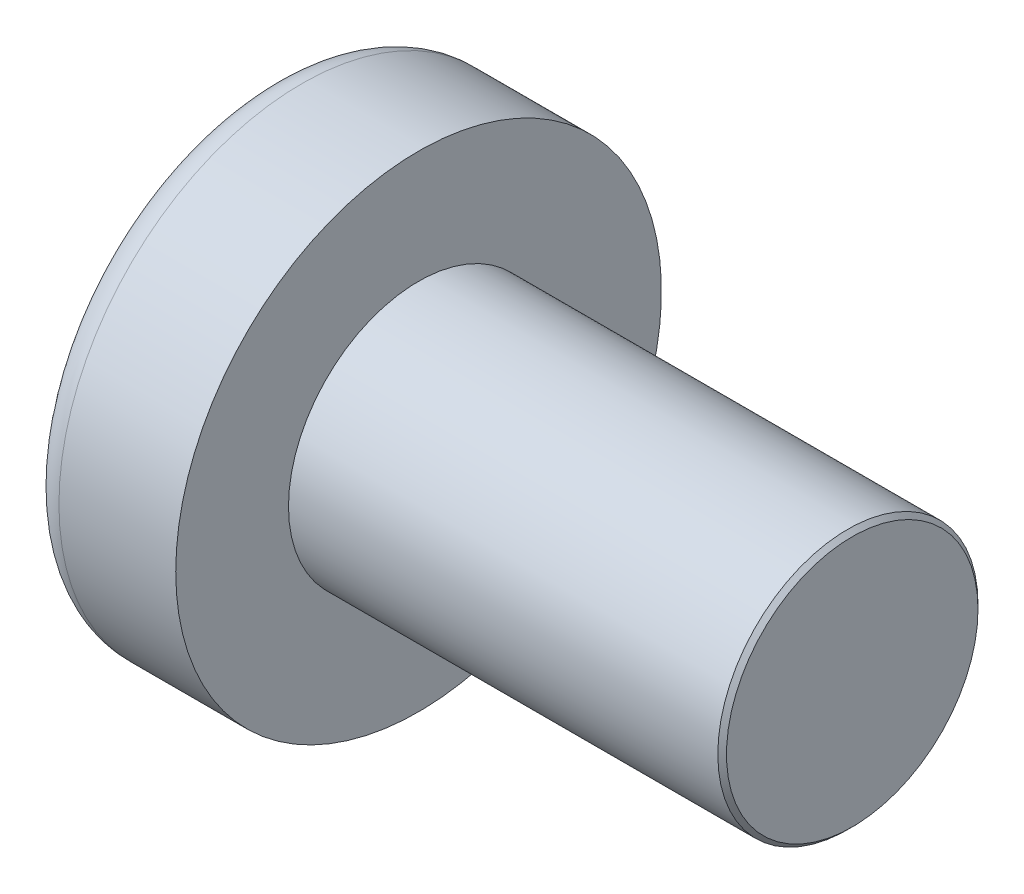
from build123d import *

# Parameters (mm, degrees)
CIRPATTERN1_COUNT = 2
CIRPATTERN1_ANGLE = 90
CHAMFER1_SIZE     = 0.05


with BuildPart() as part:
    # BodySke → Base-Revolve (revolve)
    with BuildSketch(Plane.XY, mode=Mode.PRIVATE) as base_revolve_sk:
        with BuildLine():
            Line((2.4, 1.5), (2.4, 2.8))
            Line((2.4, 2.8), (1.053355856, 2.8))
            ThreePointArc((1.053355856, 2.8), (0.878072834, 2.754445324), (0.747150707, 2.629310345))
            ThreePointArc((0.747150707, 2.629310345), (0.190413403, 1.366702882), (0, 0))
            Line((0, 0), (7.4, 0))
            Line((7.4, 0), (7.4, 1.5))
            Line((7.4, 1.5), (2.4, 1.5))
        make_face()
    revolve(base_revolve_sk.sketch.rotate(Axis((-25.4, 0, 0), (1, 0, 0)), 90), axis=Axis((-25.4, 0, 0), (1, 0, 0)))

    # Sketch3 → Cut-Loft1 section 0
    with BuildSketch(Plane(origin=(0, 0, 0), x_dir=(0, 0, -1), z_dir=(1, 0, 0))):
        with BuildLine():
            Line((0.37, -1.45), (-0.37, -1.45))
            Line((-0.37, -1.45), (-0.37, 1.45))
            Line((-0.37, 1.45), (0.37, 1.45))
            Line((0.37, 1.45), (0.37, -1.45))
        make_face()
    # Sketch4 → Cut-Loft1 section 1
    with BuildSketch(Plane(origin=(1.76, 0, 0), x_dir=(0, 0, -1), z_dir=(1, 0, 0))):
        with BuildLine():
            Line((0.185, -0.185), (-0.185, -0.185))
            Line((-0.185, -0.185), (-0.185, 0.185))
            Line((-0.185, 0.185), (0.185, 0.185))
            Line((0.185, 0.185), (0.185, -0.185))
        make_face()
    cut_loft1 = loft(mode=Mode.SUBTRACT)

    # CirPattern1: Cut-Loft1 ×2 about axis
    cirpattern1_axis = Axis((0, 0, 0), (1, 0, 0))
    for i in range(1, CIRPATTERN1_COUNT):
        add(cut_loft1.rotate(cirpattern1_axis, i * CIRPATTERN1_ANGLE / (CIRPATTERN1_COUNT - 1)), mode=Mode.SUBTRACT)

    # Chamfer1
    chamfer1_edges = [part.edges().sort_by_distance(p)[0] for p in [
        (7.4, 0, -1.5),
    ]]
    chamfer(chamfer1_edges, length=CHAMFER1_SIZE)


solid = part.part
